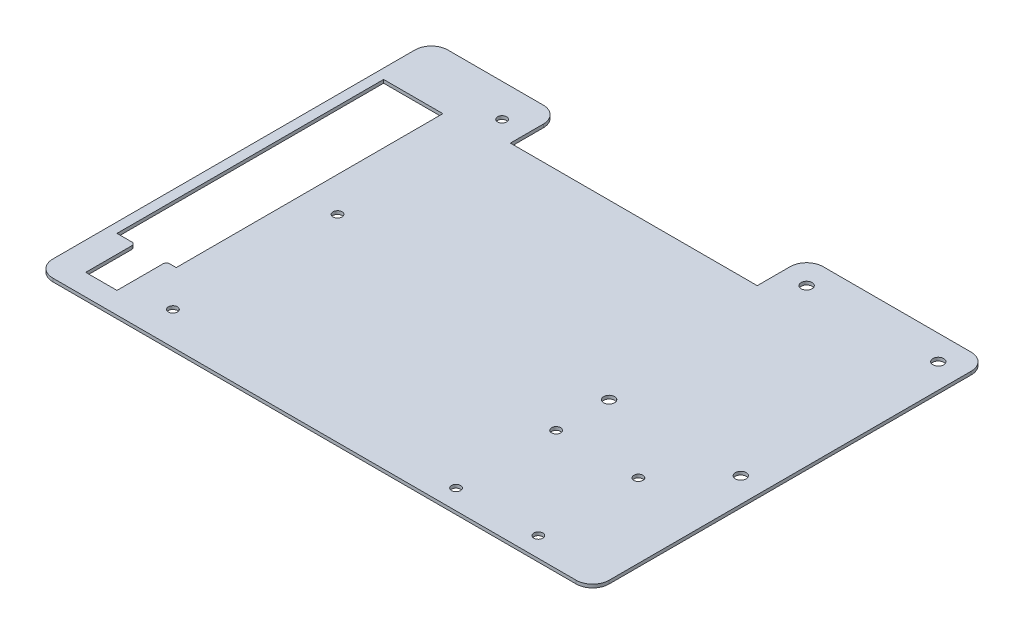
ISO-10303-21;
HEADER;
FILE_DESCRIPTION(('STEP AP214'),'2;1');
FILE_NAME('part.step','',(''),(''),'','','');
FILE_SCHEMA(('AUTOMOTIVE_DESIGN { 1 0 10303 214 1 1 1 1 }'));
ENDSEC;
DATA;
#1=APPLICATION_CONTEXT('core data for automotive mechanical design processes');
#2=APPLICATION_PROTOCOL_DEFINITION('international standard','automotive_design',2000,#1);
#3=PRODUCT_CONTEXT('',#1,'mechanical');
#4=PRODUCT('Part','Part','',(#3));
#5=PRODUCT_RELATED_PRODUCT_CATEGORY('part','',(#4));
#6=PRODUCT_DEFINITION_FORMATION('','',#4);
#7=PRODUCT_DEFINITION_CONTEXT('part definition',#1,'design');
#8=PRODUCT_DEFINITION('design','',#6,#7);
#9=PRODUCT_DEFINITION_SHAPE('','',#8);
#10=(LENGTH_UNIT() NAMED_UNIT(*) SI_UNIT(.MILLI.,.METRE.));
#11=(NAMED_UNIT(*) PLANE_ANGLE_UNIT() SI_UNIT($,.RADIAN.));
#12=(NAMED_UNIT(*) SI_UNIT($,.STERADIAN.) SOLID_ANGLE_UNIT());
#13=UNCERTAINTY_MEASURE_WITH_UNIT(LENGTH_MEASURE(1.E-05),#10,'distance_accuracy_value','');
#14=(GEOMETRIC_REPRESENTATION_CONTEXT(3) GLOBAL_UNCERTAINTY_ASSIGNED_CONTEXT((#13)) GLOBAL_UNIT_ASSIGNED_CONTEXT((#10,
#11,#12)) REPRESENTATION_CONTEXT('',''));
#15=CARTESIAN_POINT('',(0.,0.,0.));
#16=DIRECTION('',(0.,0.,1.));
#17=DIRECTION('',(1.,0.,0.));
#18=AXIS2_PLACEMENT_3D('',#15,#16,#17);
#19=CARTESIAN_POINT('',(-150.,2.,-120.));
#20=DIRECTION('',(0.,0.,1.));
#21=DIRECTION('',(1.,0.,0.));
#22=AXIS2_PLACEMENT_3D('',#19,#20,#21);
#23=PLANE('',#22);
#24=DIRECTION('',(-1.,0.,0.));
#25=VECTOR('',#24,1.);
#26=CARTESIAN_POINT('',(-150.,0.,-120.));
#27=LINE('',#26,#25);
#28=CARTESIAN_POINT('',(-110.,0.,-120.));
#29=VERTEX_POINT('',#28);
#30=CARTESIAN_POINT('',(-168.,0.,-120.));
#31=VERTEX_POINT('',#30);
#32=EDGE_CURVE('E400',#29,#31,#27,.T.);
#33=ORIENTED_EDGE('',*,*,#32,.T.);
#34=DIRECTION('',(0.,-1.,0.));
#35=VECTOR('',#34,1.);
#36=CARTESIAN_POINT('',(-168.,2.,-120.));
#37=LINE('',#36,#35);
#38=CARTESIAN_POINT('',(-168.,2.,-120.));
#39=VERTEX_POINT('',#38);
#40=EDGE_CURVE('E62',#31,#39,#37,.F.);
#41=ORIENTED_EDGE('',*,*,#40,.T.);
#42=DIRECTION('',(-1.,0.,0.));
#43=VECTOR('',#42,1.);
#44=CARTESIAN_POINT('',(-150.,2.,-120.));
#45=LINE('',#44,#43);
#46=CARTESIAN_POINT('',(-110.,2.,-120.));
#47=VERTEX_POINT('',#46);
#48=EDGE_CURVE('E388',#47,#39,#45,.T.);
#49=ORIENTED_EDGE('',*,*,#48,.F.);
#50=DIRECTION('',(0.,1.,0.));
#51=VECTOR('',#50,1.);
#52=CARTESIAN_POINT('',(-110.,2.,-120.));
#53=LINE('',#52,#51);
#54=EDGE_CURVE('E437',#47,#29,#53,.F.);
#55=ORIENTED_EDGE('',*,*,#54,.T.);
#56=EDGE_LOOP('',(#33,#41,#49,#55));
#57=FACE_BOUND('',#56,.T.);
#58=ADVANCED_FACE('F39',(#57),#23,.F.);
#59=CARTESIAN_POINT('',(-150.,2.,120.));
#60=DIRECTION('',(0.,0.,-1.));
#61=DIRECTION('',(-1.,0.,0.));
#62=AXIS2_PLACEMENT_3D('',#59,#60,#61);
#63=PLANE('',#62);
#64=DIRECTION('',(1.,0.,0.));
#65=VECTOR('',#64,1.);
#66=CARTESIAN_POINT('',(-150.,2.,120.));
#67=LINE('',#66,#65);
#68=CARTESIAN_POINT('',(-168.,2.,120.));
#69=VERTEX_POINT('',#68);
#70=CARTESIAN_POINT('',(150.,2.,120.));
#71=VERTEX_POINT('',#70);
#72=EDGE_CURVE('E379',#69,#71,#67,.T.);
#73=ORIENTED_EDGE('',*,*,#72,.F.);
#74=DIRECTION('',(0.,-1.,0.));
#75=VECTOR('',#74,1.);
#76=CARTESIAN_POINT('',(-168.,2.,120.));
#77=LINE('',#76,#75);
#78=CARTESIAN_POINT('',(-168.,0.,120.));
#79=VERTEX_POINT('',#78);
#80=EDGE_CURVE('E11',#69,#79,#77,.T.);
#81=ORIENTED_EDGE('',*,*,#80,.T.);
#82=DIRECTION('',(1.,0.,0.));
#83=VECTOR('',#82,1.);
#84=CARTESIAN_POINT('',(-150.,0.,120.));
#85=LINE('',#84,#83);
#86=CARTESIAN_POINT('',(150.,0.,120.));
#87=VERTEX_POINT('',#86);
#88=EDGE_CURVE('E364',#79,#87,#85,.T.);
#89=ORIENTED_EDGE('',*,*,#88,.T.);
#90=DIRECTION('',(0.,-1.,0.));
#91=VECTOR('',#90,1.);
#92=CARTESIAN_POINT('',(150.,2.,120.));
#93=LINE('',#92,#91);
#94=EDGE_CURVE('E411',#71,#87,#93,.T.);
#95=ORIENTED_EDGE('',*,*,#94,.F.);
#96=EDGE_LOOP('',(#73,#81,#89,#95));
#97=FACE_BOUND('',#96,.T.);
#98=ADVANCED_FACE('F508',(#97),#63,.F.);
#99=CARTESIAN_POINT('',(150.,2.,110.));
#100=DIRECTION('',(0.,-1.,0.));
#101=DIRECTION('',(0.,0.,-1.));
#102=AXIS2_PLACEMENT_3D('',#99,#100,#101);
#103=CYLINDRICAL_SURFACE('',#102,10.);
#104=CARTESIAN_POINT('',(150.,0.,110.));
#105=DIRECTION('',(0.,1.,0.));
#106=DIRECTION('',(0.,0.,1.));
#107=AXIS2_PLACEMENT_3D('',#104,#105,#106);
#108=CIRCLE('',#107,10.);
#109=CARTESIAN_POINT('',(160.,0.,110.));
#110=VERTEX_POINT('',#109);
#111=EDGE_CURVE('E394',#87,#110,#108,.T.);
#112=ORIENTED_EDGE('',*,*,#111,.T.);
#113=DIRECTION('',(0.,-1.,0.));
#114=VECTOR('',#113,1.);
#115=CARTESIAN_POINT('',(160.,2.,110.));
#116=LINE('',#115,#114);
#117=CARTESIAN_POINT('',(160.,2.,110.));
#118=VERTEX_POINT('',#117);
#119=EDGE_CURVE('E408',#118,#110,#116,.T.);
#120=ORIENTED_EDGE('',*,*,#119,.F.);
#121=CARTESIAN_POINT('',(150.,2.,110.));
#122=DIRECTION('',(0.,1.,0.));
#123=DIRECTION('',(0.,0.,1.));
#124=AXIS2_PLACEMENT_3D('',#121,#122,#123);
#125=CIRCLE('',#124,10.);
#126=EDGE_CURVE('E381',#71,#118,#125,.T.);
#127=ORIENTED_EDGE('',*,*,#126,.F.);
#128=ORIENTED_EDGE('',*,*,#94,.T.);
#129=EDGE_LOOP('',(#112,#120,#127,#128));
#130=FACE_BOUND('',#129,.T.);
#131=ADVANCED_FACE('F505',(#130),#103,.T.);
#132=CARTESIAN_POINT('',(160.,2.,110.));
#133=DIRECTION('',(-1.,0.,0.));
#134=DIRECTION('',(0.,0.,1.));
#135=AXIS2_PLACEMENT_3D('',#132,#133,#134);
#136=PLANE('',#135);
#137=DIRECTION('',(0.,0.,-1.));
#138=VECTOR('',#137,1.);
#139=CARTESIAN_POINT('',(160.,0.,110.));
#140=LINE('',#139,#138);
#141=CARTESIAN_POINT('',(160.,0.,-110.));
#142=VERTEX_POINT('',#141);
#143=EDGE_CURVE('E396',#110,#142,#140,.T.);
#144=ORIENTED_EDGE('',*,*,#143,.T.);
#145=DIRECTION('',(0.,-1.,0.));
#146=VECTOR('',#145,1.);
#147=CARTESIAN_POINT('',(160.,2.,-110.));
#148=LINE('',#147,#146);
#149=CARTESIAN_POINT('',(160.,2.,-110.));
#150=VERTEX_POINT('',#149);
#151=EDGE_CURVE('E405',#150,#142,#148,.T.);
#152=ORIENTED_EDGE('',*,*,#151,.F.);
#153=DIRECTION('',(0.,0.,-1.));
#154=VECTOR('',#153,1.);
#155=CARTESIAN_POINT('',(160.,2.,110.));
#156=LINE('',#155,#154);
#157=EDGE_CURVE('E384',#118,#150,#156,.T.);
#158=ORIENTED_EDGE('',*,*,#157,.F.);
#159=ORIENTED_EDGE('',*,*,#119,.T.);
#160=EDGE_LOOP('',(#144,#152,#158,#159));
#161=FACE_BOUND('',#160,.T.);
#162=ADVANCED_FACE('F500',(#161),#136,.F.);
#163=CARTESIAN_POINT('',(150.,2.,-110.));
#164=DIRECTION('',(0.,-1.,0.));
#165=DIRECTION('',(0.,0.,-1.));
#166=AXIS2_PLACEMENT_3D('',#163,#164,#165);
#167=CYLINDRICAL_SURFACE('',#166,10.);
#168=CARTESIAN_POINT('',(150.,0.,-110.));
#169=DIRECTION('',(0.,1.,0.));
#170=DIRECTION('',(0.,0.,-1.));
#171=AXIS2_PLACEMENT_3D('',#168,#169,#170);
#172=CIRCLE('',#171,10.);
#173=CARTESIAN_POINT('',(150.,0.,-120.));
#174=VERTEX_POINT('',#173);
#175=EDGE_CURVE('E398',#142,#174,#172,.T.);
#176=ORIENTED_EDGE('',*,*,#175,.T.);
#177=DIRECTION('',(0.,-1.,0.));
#178=VECTOR('',#177,1.);
#179=CARTESIAN_POINT('',(150.,2.,-120.));
#180=LINE('',#179,#178);
#181=CARTESIAN_POINT('',(150.,2.,-120.));
#182=VERTEX_POINT('',#181);
#183=EDGE_CURVE('E392',#182,#174,#180,.T.);
#184=ORIENTED_EDGE('',*,*,#183,.F.);
#185=CARTESIAN_POINT('',(150.,2.,-110.));
#186=DIRECTION('',(0.,1.,0.));
#187=DIRECTION('',(0.,0.,-1.));
#188=AXIS2_PLACEMENT_3D('',#185,#186,#187);
#189=CIRCLE('',#188,10.);
#190=EDGE_CURVE('E386',#150,#182,#189,.T.);
#191=ORIENTED_EDGE('',*,*,#190,.F.);
#192=ORIENTED_EDGE('',*,*,#151,.T.);
#193=EDGE_LOOP('',(#176,#184,#191,#192));
#194=FACE_BOUND('',#193,.T.);
#195=ADVANCED_FACE('F494',(#194),#167,.T.);
#196=CARTESIAN_POINT('',(60.0000000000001,0.,-120.));
#197=VERTEX_POINT('',#196);
#198=EDGE_CURVE('E382',#174,#197,#27,.T.);
#199=ORIENTED_EDGE('',*,*,#198,.T.);
#200=DIRECTION('',(0.,1.,0.));
#201=VECTOR('',#200,1.);
#202=CARTESIAN_POINT('',(60.0000000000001,2.,-120.));
#203=LINE('',#202,#201);
#204=CARTESIAN_POINT('',(60.0000000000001,2.,-120.));
#205=VERTEX_POINT('',#204);
#206=EDGE_CURVE('E421',#197,#205,#203,.T.);
#207=ORIENTED_EDGE('',*,*,#206,.T.);
#208=EDGE_CURVE('E389',#182,#205,#45,.T.);
#209=ORIENTED_EDGE('',*,*,#208,.F.);
#210=ORIENTED_EDGE('',*,*,#183,.T.);
#211=EDGE_LOOP('',(#199,#207,#209,#210));
#212=FACE_BOUND('',#211,.T.);
#213=ADVANCED_FACE('F489',(#212),#23,.F.);
#214=CARTESIAN_POINT('',(-150.,2.,110.));
#215=DIRECTION('',(0.,-1.,0.));
#216=DIRECTION('',(0.,0.,-1.));
#217=AXIS2_PLACEMENT_3D('',#214,#215,#216);
#218=PLANE('',#217);
#219=DIRECTION('',(1.,0.,0.));
#220=VECTOR('',#219,1.);
#221=CARTESIAN_POINT('',(-172.,2.,77.));
#222=LINE('',#221,#220);
#223=CARTESIAN_POINT('',(-172.,2.,77.));
#224=VERTEX_POINT('',#223);
#225=CARTESIAN_POINT('',(-163.,2.,77.));
#226=VERTEX_POINT('',#225);
#227=EDGE_CURVE('E255',#224,#226,#222,.T.);
#228=ORIENTED_EDGE('',*,*,#227,.F.);
#229=DIRECTION('',(0.,0.,1.));
#230=VECTOR('',#229,1.);
#231=CARTESIAN_POINT('',(-172.,2.,77.));
#232=LINE('',#231,#230);
#233=CARTESIAN_POINT('',(-172.,2.,-85.));
#234=VERTEX_POINT('',#233);
#235=EDGE_CURVE('E210',#234,#224,#232,.T.);
#236=ORIENTED_EDGE('',*,*,#235,.F.);
#237=DIRECTION('',(-1.,0.,0.));
#238=VECTOR('',#237,1.);
#239=CARTESIAN_POINT('',(-172.,2.,-85.));
#240=LINE('',#239,#238);
#241=CARTESIAN_POINT('',(-136.,2.,-85.));
#242=VERTEX_POINT('',#241);
#243=EDGE_CURVE('E229',#242,#234,#240,.T.);
#244=ORIENTED_EDGE('',*,*,#243,.F.);
#245=DIRECTION('',(0.,0.,-1.));
#246=VECTOR('',#245,1.);
#247=CARTESIAN_POINT('',(-136.,2.,77.));
#248=LINE('',#247,#246);
#249=CARTESIAN_POINT('',(-136.,2.,77.));
#250=VERTEX_POINT('',#249);
#251=EDGE_CURVE('E232',#250,#242,#248,.T.);
#252=ORIENTED_EDGE('',*,*,#251,.F.);
#253=DIRECTION('',(1.,0.,0.));
#254=VECTOR('',#253,1.);
#255=CARTESIAN_POINT('',(-140.,2.,77.));
#256=LINE('',#255,#254);
#257=CARTESIAN_POINT('',(-140.,2.,77.));
#258=VERTEX_POINT('',#257);
#259=EDGE_CURVE('E272',#258,#250,#256,.T.);
#260=ORIENTED_EDGE('',*,*,#259,.F.);
#261=CARTESIAN_POINT('',(-140.,2.,79.));
#262=DIRECTION('',(0.,-1.,0.));
#263=DIRECTION('',(0.,0.,1.));
#264=AXIS2_PLACEMENT_3D('',#261,#262,#263);
#265=CIRCLE('',#264,2.);
#266=CARTESIAN_POINT('',(-142.,2.,79.));
#267=VERTEX_POINT('',#266);
#268=EDGE_CURVE('E269',#267,#258,#265,.T.);
#269=ORIENTED_EDGE('',*,*,#268,.F.);
#270=DIRECTION('',(0.,0.,-1.));
#271=VECTOR('',#270,1.);
#272=CARTESIAN_POINT('',(-142.,2.,79.));
#273=LINE('',#272,#271);
#274=CARTESIAN_POINT('',(-142.,2.,107.));
#275=VERTEX_POINT('',#274);
#276=EDGE_CURVE('E266',#275,#267,#273,.T.);
#277=ORIENTED_EDGE('',*,*,#276,.F.);
#278=DIRECTION('',(1.,0.,0.));
#279=VECTOR('',#278,1.);
#280=CARTESIAN_POINT('',(-161.,2.,107.));
#281=LINE('',#280,#279);
#282=CARTESIAN_POINT('',(-161.,2.,107.));
#283=VERTEX_POINT('',#282);
#284=EDGE_CURVE('E263',#283,#275,#281,.T.);
#285=ORIENTED_EDGE('',*,*,#284,.F.);
#286=DIRECTION('',(0.,0.,1.));
#287=VECTOR('',#286,1.);
#288=CARTESIAN_POINT('',(-161.,2.,79.0000000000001));
#289=LINE('',#288,#287);
#290=CARTESIAN_POINT('',(-161.,2.,79.0000000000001));
#291=VERTEX_POINT('',#290);
#292=EDGE_CURVE('E260',#291,#283,#289,.T.);
#293=ORIENTED_EDGE('',*,*,#292,.F.);
#294=CARTESIAN_POINT('',(-163.,2.,79.));
#295=DIRECTION('',(0.,-1.,0.));
#296=DIRECTION('',(0.,0.,-1.));
#297=AXIS2_PLACEMENT_3D('',#294,#295,#296);
#298=CIRCLE('',#297,2.);
#299=EDGE_CURVE('E257',#226,#291,#298,.T.);
#300=ORIENTED_EDGE('',*,*,#299,.F.);
#301=EDGE_LOOP('',(#228,#236,#244,#252,#260,#269,#277,#285,#293,#300));
#302=FACE_BOUND('',#301,.T.);
#303=ORIENTED_EDGE('',*,*,#48,.T.);
#304=CARTESIAN_POINT('',(-168.,2.,-110.));
#305=DIRECTION('',(0.,-1.,0.));
#306=DIRECTION('',(0.,0.,-1.));
#307=AXIS2_PLACEMENT_3D('',#304,#305,#306);
#308=CIRCLE('',#307,10.);
#309=CARTESIAN_POINT('',(-178.,2.,-110.));
#310=VERTEX_POINT('',#309);
#311=EDGE_CURVE('E47',#39,#310,#308,.F.);
#312=ORIENTED_EDGE('',*,*,#311,.T.);
#313=DIRECTION('',(0.,0.,1.));
#314=VECTOR('',#313,1.);
#315=CARTESIAN_POINT('',(-178.,2.,120.));
#316=LINE('',#315,#314);
#317=CARTESIAN_POINT('',(-178.,2.,110.));
#318=VERTEX_POINT('',#317);
#319=EDGE_CURVE('E295',#310,#318,#316,.T.);
#320=ORIENTED_EDGE('',*,*,#319,.T.);
#321=CARTESIAN_POINT('',(-168.,2.,110.));
#322=DIRECTION('',(0.,-1.,0.));
#323=DIRECTION('',(0.,0.,-1.));
#324=AXIS2_PLACEMENT_3D('',#321,#322,#323);
#325=CIRCLE('',#324,10.);
#326=EDGE_CURVE('E54',#318,#69,#325,.F.);
#327=ORIENTED_EDGE('',*,*,#326,.T.);
#328=ORIENTED_EDGE('',*,*,#72,.T.);
#329=ORIENTED_EDGE('',*,*,#126,.T.);
#330=ORIENTED_EDGE('',*,*,#157,.T.);
#331=ORIENTED_EDGE('',*,*,#190,.T.);
#332=ORIENTED_EDGE('',*,*,#208,.T.);
#333=CARTESIAN_POINT('',(60.0000000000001,2.,-110.));
#334=DIRECTION('',(0.,-1.,0.));
#335=DIRECTION('',(0.,0.,-1.));
#336=AXIS2_PLACEMENT_3D('',#333,#334,#335);
#337=CIRCLE('',#336,10.);
#338=CARTESIAN_POINT('',(50.0000000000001,2.,-110.));
#339=VERTEX_POINT('',#338);
#340=EDGE_CURVE('E426',#205,#339,#337,.F.);
#341=ORIENTED_EDGE('',*,*,#340,.T.);
#342=DIRECTION('',(0.,0.,-1.));
#343=VECTOR('',#342,1.);
#344=CARTESIAN_POINT('',(50.0000000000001,2.,-120.));
#345=LINE('',#344,#343);
#346=CARTESIAN_POINT('',(50.0000000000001,2.,-90.));
#347=VERTEX_POINT('',#346);
#348=EDGE_CURVE('E304',#347,#339,#345,.T.);
#349=ORIENTED_EDGE('',*,*,#348,.F.);
#350=DIRECTION('',(1.,0.,0.));
#351=VECTOR('',#350,1.);
#352=CARTESIAN_POINT('',(-100.,2.,-90.));
#353=LINE('',#352,#351);
#354=CARTESIAN_POINT('',(-100.,2.,-90.));
#355=VERTEX_POINT('',#354);
#356=EDGE_CURVE('E301',#355,#347,#353,.T.);
#357=ORIENTED_EDGE('',*,*,#356,.F.);
#358=DIRECTION('',(0.,0.,1.));
#359=VECTOR('',#358,1.);
#360=CARTESIAN_POINT('',(-100.,2.,-120.));
#361=LINE('',#360,#359);
#362=CARTESIAN_POINT('',(-100.,2.,-110.));
#363=VERTEX_POINT('',#362);
#364=EDGE_CURVE('E297',#363,#355,#361,.T.);
#365=ORIENTED_EDGE('',*,*,#364,.F.);
#366=CARTESIAN_POINT('',(-110.,2.,-110.));
#367=DIRECTION('',(0.,-1.,0.));
#368=DIRECTION('',(0.,0.,-1.));
#369=AXIS2_PLACEMENT_3D('',#366,#367,#368);
#370=CIRCLE('',#369,10.);
#371=EDGE_CURVE('E424',#363,#47,#370,.F.);
#372=ORIENTED_EDGE('',*,*,#371,.T.);
#373=EDGE_LOOP('',(#303,#312,#320,#327,#328,#329,#330,#331,#332,#341,#349,#357,#365,#372));
#374=FACE_BOUND('',#373,.T.);
#375=CARTESIAN_POINT('',(-115.,2.,-100.));
#376=DIRECTION('',(0.,1.,0.));
#377=DIRECTION('',(0.,0.,1.));
#378=AXIS2_PLACEMENT_3D('',#375,#376,#377);
#379=CIRCLE('',#378,2.75000000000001);
#380=CARTESIAN_POINT('',(-115.,2.,-97.25));
#381=VERTEX_POINT('',#380);
#382=EDGE_CURVE('E374',#381,#381,#379,.T.);
#383=ORIENTED_EDGE('',*,*,#382,.F.);
#384=EDGE_LOOP('',(#383));
#385=FACE_BOUND('',#384,.T.);
#386=CARTESIAN_POINT('',(-115.,2.,0.));
#387=DIRECTION('',(0.,1.,0.));
#388=DIRECTION('',(0.,0.,1.));
#389=AXIS2_PLACEMENT_3D('',#386,#387,#388);
#390=CIRCLE('',#389,2.75000000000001);
#391=CARTESIAN_POINT('',(-115.,2.,2.75000000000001));
#392=VERTEX_POINT('',#391);
#393=EDGE_CURVE('E368',#392,#392,#390,.T.);
#394=ORIENTED_EDGE('',*,*,#393,.F.);
#395=EDGE_LOOP('',(#394));
#396=FACE_BOUND('',#395,.T.);
#397=CARTESIAN_POINT('',(-115.,2.,100.));
#398=DIRECTION('',(0.,1.,0.));
#399=DIRECTION('',(0.,0.,1.));
#400=AXIS2_PLACEMENT_3D('',#397,#398,#399);
#401=CIRCLE('',#400,2.75000000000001);
#402=CARTESIAN_POINT('',(-115.,2.,102.75));
#403=VERTEX_POINT('',#402);
#404=EDGE_CURVE('E365',#403,#403,#401,.T.);
#405=ORIENTED_EDGE('',*,*,#404,.F.);
#406=EDGE_LOOP('',(#405));
#407=FACE_BOUND('',#406,.T.);
#408=CARTESIAN_POINT('',(145.,2.,-105.));
#409=DIRECTION('',(0.,1.,0.));
#410=DIRECTION('',(0.,0.,1.));
#411=AXIS2_PLACEMENT_3D('',#408,#409,#410);
#412=CIRCLE('',#411,3.3);
#413=CARTESIAN_POINT('',(145.,2.,-101.7));
#414=VERTEX_POINT('',#413);
#415=EDGE_CURVE('E346',#414,#414,#412,.T.);
#416=ORIENTED_EDGE('',*,*,#415,.F.);
#417=EDGE_LOOP('',(#416));
#418=FACE_BOUND('',#417,.T.);
#419=CARTESIAN_POINT('',(115.,2.,47.2));
#420=DIRECTION('',(0.,1.,0.));
#421=DIRECTION('',(0.,0.,1.));
#422=AXIS2_PLACEMENT_3D('',#419,#420,#421);
#423=CIRCLE('',#422,2.75000000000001);
#424=CARTESIAN_POINT('',(115.,2.,49.95));
#425=VERTEX_POINT('',#424);
#426=EDGE_CURVE('E326',#425,#425,#423,.T.);
#427=ORIENTED_EDGE('',*,*,#426,.F.);
#428=EDGE_LOOP('',(#427));
#429=FACE_BOUND('',#428,.T.);
#430=CARTESIAN_POINT('',(65.0000000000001,2.,47.2));
#431=DIRECTION('',(0.,1.,0.));
#432=DIRECTION('',(0.,0.,1.));
#433=AXIS2_PLACEMENT_3D('',#430,#431,#432);
#434=CIRCLE('',#433,2.75000000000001);
#435=CARTESIAN_POINT('',(65.0000000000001,2.,49.95));
#436=VERTEX_POINT('',#435);
#437=EDGE_CURVE('E320',#436,#436,#434,.T.);
#438=ORIENTED_EDGE('',*,*,#437,.F.);
#439=EDGE_LOOP('',(#438));
#440=FACE_BOUND('',#439,.T.);
#441=CARTESIAN_POINT('',(65.0000000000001,2.,108.));
#442=DIRECTION('',(0.,1.,0.));
#443=DIRECTION('',(0.,0.,1.));
#444=AXIS2_PLACEMENT_3D('',#441,#442,#443);
#445=CIRCLE('',#444,2.75000000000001);
#446=CARTESIAN_POINT('',(65.0000000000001,2.,110.75));
#447=VERTEX_POINT('',#446);
#448=EDGE_CURVE('E313',#447,#447,#445,.T.);
#449=ORIENTED_EDGE('',*,*,#448,.F.);
#450=EDGE_LOOP('',(#449));
#451=FACE_BOUND('',#450,.T.);
#452=CARTESIAN_POINT('',(65.0000000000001,2.,15.));
#453=DIRECTION('',(0.,1.,0.));
#454=DIRECTION('',(0.,0.,1.));
#455=AXIS2_PLACEMENT_3D('',#452,#453,#454);
#456=CIRCLE('',#455,3.30000000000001);
#457=CARTESIAN_POINT('',(65.0000000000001,2.,18.3));
#458=VERTEX_POINT('',#457);
#459=EDGE_CURVE('E343',#458,#458,#456,.T.);
#460=ORIENTED_EDGE('',*,*,#459,.F.);
#461=EDGE_LOOP('',(#460));
#462=FACE_BOUND('',#461,.T.);
#463=CARTESIAN_POINT('',(145.,2.,15.));
#464=DIRECTION('',(0.,1.,0.));
#465=DIRECTION('',(0.,0.,1.));
#466=AXIS2_PLACEMENT_3D('',#463,#464,#465);
#467=CIRCLE('',#466,3.3);
#468=CARTESIAN_POINT('',(145.,2.,18.3));
#469=VERTEX_POINT('',#468);
#470=EDGE_CURVE('E350',#469,#469,#467,.T.);
#471=ORIENTED_EDGE('',*,*,#470,.F.);
#472=EDGE_LOOP('',(#471));
#473=FACE_BOUND('',#472,.T.);
#474=CARTESIAN_POINT('',(65.0000000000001,2.,-105.));
#475=DIRECTION('',(0.,1.,0.));
#476=DIRECTION('',(0.,0.,1.));
#477=AXIS2_PLACEMENT_3D('',#474,#475,#476);
#478=CIRCLE('',#477,3.29999999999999);
#479=CARTESIAN_POINT('',(65.0000000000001,2.,-101.7));
#480=VERTEX_POINT('',#479);
#481=EDGE_CURVE('E331',#480,#480,#478,.T.);
#482=ORIENTED_EDGE('',*,*,#481,.F.);
#483=EDGE_LOOP('',(#482));
#484=FACE_BOUND('',#483,.T.);
#485=CARTESIAN_POINT('',(115.,2.,108.));
#486=DIRECTION('',(0.,1.,0.));
#487=DIRECTION('',(0.,0.,1.));
#488=AXIS2_PLACEMENT_3D('',#485,#486,#487);
#489=CIRCLE('',#488,2.75000000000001);
#490=CARTESIAN_POINT('',(115.,2.,110.75));
#491=VERTEX_POINT('',#490);
#492=EDGE_CURVE('E338',#491,#491,#489,.T.);
#493=ORIENTED_EDGE('',*,*,#492,.F.);
#494=EDGE_LOOP('',(#493));
#495=FACE_BOUND('',#494,.T.);
#496=ADVANCED_FACE('F451',(#302,#374,#385,#396,#407,#418,#429,#440,#451,#462,#473,#484,#495),
#218,.F.);
#497=CARTESIAN_POINT('',(-150.,0.,110.));
#498=DIRECTION('',(0.,-1.,0.));
#499=DIRECTION('',(0.,0.,-1.));
#500=AXIS2_PLACEMENT_3D('',#497,#498,#499);
#501=PLANE('',#500);
#502=DIRECTION('',(0.,0.,1.));
#503=VECTOR('',#502,1.);
#504=CARTESIAN_POINT('',(-172.,0.,77.));
#505=LINE('',#504,#503);
#506=CARTESIAN_POINT('',(-172.,0.,-85.));
#507=VERTEX_POINT('',#506);
#508=CARTESIAN_POINT('',(-172.,0.,77.));
#509=VERTEX_POINT('',#508);
#510=EDGE_CURVE('E207',#507,#509,#505,.T.);
#511=ORIENTED_EDGE('',*,*,#510,.T.);
#512=DIRECTION('',(1.,0.,0.));
#513=VECTOR('',#512,1.);
#514=CARTESIAN_POINT('',(-172.,0.,77.));
#515=LINE('',#514,#513);
#516=CARTESIAN_POINT('',(-163.,0.,77.));
#517=VERTEX_POINT('',#516);
#518=EDGE_CURVE('E219',#509,#517,#515,.T.);
#519=ORIENTED_EDGE('',*,*,#518,.T.);
#520=CARTESIAN_POINT('',(-163.,0.,79.));
#521=DIRECTION('',(0.,-1.,0.));
#522=DIRECTION('',(0.,0.,-1.));
#523=AXIS2_PLACEMENT_3D('',#520,#521,#522);
#524=CIRCLE('',#523,2.);
#525=CARTESIAN_POINT('',(-161.,0.,79.0000000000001));
#526=VERTEX_POINT('',#525);
#527=EDGE_CURVE('E223',#517,#526,#524,.T.);
#528=ORIENTED_EDGE('',*,*,#527,.T.);
#529=DIRECTION('',(0.,0.,1.));
#530=VECTOR('',#529,1.);
#531=CARTESIAN_POINT('',(-161.,0.,79.0000000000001));
#532=LINE('',#531,#530);
#533=CARTESIAN_POINT('',(-161.,0.,107.));
#534=VERTEX_POINT('',#533);
#535=EDGE_CURVE('E236',#526,#534,#532,.T.);
#536=ORIENTED_EDGE('',*,*,#535,.T.);
#537=DIRECTION('',(1.,0.,0.));
#538=VECTOR('',#537,1.);
#539=CARTESIAN_POINT('',(-161.,0.,107.));
#540=LINE('',#539,#538);
#541=CARTESIAN_POINT('',(-142.,0.,107.));
#542=VERTEX_POINT('',#541);
#543=EDGE_CURVE('E239',#534,#542,#540,.T.);
#544=ORIENTED_EDGE('',*,*,#543,.T.);
#545=DIRECTION('',(0.,0.,-1.));
#546=VECTOR('',#545,1.);
#547=CARTESIAN_POINT('',(-142.,0.,79.));
#548=LINE('',#547,#546);
#549=CARTESIAN_POINT('',(-142.,0.,79.));
#550=VERTEX_POINT('',#549);
#551=EDGE_CURVE('E242',#542,#550,#548,.T.);
#552=ORIENTED_EDGE('',*,*,#551,.T.);
#553=CARTESIAN_POINT('',(-140.,0.,79.));
#554=DIRECTION('',(0.,-1.,0.));
#555=DIRECTION('',(0.,0.,1.));
#556=AXIS2_PLACEMENT_3D('',#553,#554,#555);
#557=CIRCLE('',#556,2.);
#558=CARTESIAN_POINT('',(-140.,0.,77.));
#559=VERTEX_POINT('',#558);
#560=EDGE_CURVE('E245',#550,#559,#557,.T.);
#561=ORIENTED_EDGE('',*,*,#560,.T.);
#562=DIRECTION('',(1.,0.,0.));
#563=VECTOR('',#562,1.);
#564=CARTESIAN_POINT('',(-140.,0.,77.));
#565=LINE('',#564,#563);
#566=CARTESIAN_POINT('',(-136.,0.,77.));
#567=VERTEX_POINT('',#566);
#568=EDGE_CURVE('E248',#559,#567,#565,.T.);
#569=ORIENTED_EDGE('',*,*,#568,.T.);
#570=DIRECTION('',(0.,0.,-1.));
#571=VECTOR('',#570,1.);
#572=CARTESIAN_POINT('',(-136.,0.,77.));
#573=LINE('',#572,#571);
#574=CARTESIAN_POINT('',(-136.,0.,-85.));
#575=VERTEX_POINT('',#574);
#576=EDGE_CURVE('E251',#567,#575,#573,.T.);
#577=ORIENTED_EDGE('',*,*,#576,.T.);
#578=DIRECTION('',(-1.,0.,0.));
#579=VECTOR('',#578,1.);
#580=CARTESIAN_POINT('',(-172.,0.,-85.));
#581=LINE('',#580,#579);
#582=EDGE_CURVE('E215',#575,#507,#581,.T.);
#583=ORIENTED_EDGE('',*,*,#582,.T.);
#584=EDGE_LOOP('',(#511,#519,#528,#536,#544,#552,#561,#569,#577,#583));
#585=FACE_BOUND('',#584,.T.);
#586=DIRECTION('',(0.,0.,1.));
#587=VECTOR('',#586,1.);
#588=CARTESIAN_POINT('',(-178.,0.,120.));
#589=LINE('',#588,#587);
#590=CARTESIAN_POINT('',(-178.,0.,-110.));
#591=VERTEX_POINT('',#590);
#592=CARTESIAN_POINT('',(-178.,0.,110.));
#593=VERTEX_POINT('',#592);
#594=EDGE_CURVE('E279',#591,#593,#589,.T.);
#595=ORIENTED_EDGE('',*,*,#594,.F.);
#596=CARTESIAN_POINT('',(-168.,0.,-110.));
#597=DIRECTION('',(0.,-1.,0.));
#598=DIRECTION('',(0.,0.,-1.));
#599=AXIS2_PLACEMENT_3D('',#596,#597,#598);
#600=CIRCLE('',#599,10.);
#601=EDGE_CURVE('E446',#591,#31,#600,.T.);
#602=ORIENTED_EDGE('',*,*,#601,.T.);
#603=ORIENTED_EDGE('',*,*,#32,.F.);
#604=CARTESIAN_POINT('',(-110.,0.,-110.));
#605=DIRECTION('',(0.,-1.,0.));
#606=DIRECTION('',(0.,0.,-1.));
#607=AXIS2_PLACEMENT_3D('',#604,#605,#606);
#608=CIRCLE('',#607,10.);
#609=CARTESIAN_POINT('',(-100.,0.,-110.));
#610=VERTEX_POINT('',#609);
#611=EDGE_CURVE('E430',#29,#610,#608,.T.);
#612=ORIENTED_EDGE('',*,*,#611,.T.);
#613=DIRECTION('',(0.,0.,-1.));
#614=VECTOR('',#613,1.);
#615=CARTESIAN_POINT('',(-100.,0.,110.));
#616=LINE('',#615,#614);
#617=CARTESIAN_POINT('',(-100.,0.,-90.));
#618=VERTEX_POINT('',#617);
#619=EDGE_CURVE('E418',#618,#610,#616,.T.);
#620=ORIENTED_EDGE('',*,*,#619,.F.);
#621=DIRECTION('',(-1.,0.,0.));
#622=VECTOR('',#621,1.);
#623=CARTESIAN_POINT('',(-150.,0.,-90.));
#624=LINE('',#623,#622);
#625=CARTESIAN_POINT('',(50.0000000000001,0.,-90.));
#626=VERTEX_POINT('',#625);
#627=EDGE_CURVE('E414',#626,#618,#624,.T.);
#628=ORIENTED_EDGE('',*,*,#627,.F.);
#629=DIRECTION('',(0.,0.,1.));
#630=VECTOR('',#629,1.);
#631=CARTESIAN_POINT('',(50.0000000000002,0.,110.));
#632=LINE('',#631,#630);
#633=CARTESIAN_POINT('',(50.0000000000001,0.,-110.));
#634=VERTEX_POINT('',#633);
#635=EDGE_CURVE('E416',#634,#626,#632,.T.);
#636=ORIENTED_EDGE('',*,*,#635,.F.);
#637=CARTESIAN_POINT('',(60.0000000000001,0.,-110.));
#638=DIRECTION('',(0.,-1.,0.));
#639=DIRECTION('',(0.,0.,-1.));
#640=AXIS2_PLACEMENT_3D('',#637,#638,#639);
#641=CIRCLE('',#640,10.);
#642=EDGE_CURVE('E432',#634,#197,#641,.T.);
#643=ORIENTED_EDGE('',*,*,#642,.T.);
#644=ORIENTED_EDGE('',*,*,#198,.F.);
#645=ORIENTED_EDGE('',*,*,#175,.F.);
#646=ORIENTED_EDGE('',*,*,#143,.F.);
#647=ORIENTED_EDGE('',*,*,#111,.F.);
#648=ORIENTED_EDGE('',*,*,#88,.F.);
#649=CARTESIAN_POINT('',(-168.,0.,110.));
#650=DIRECTION('',(0.,-1.,0.));
#651=DIRECTION('',(0.,0.,-1.));
#652=AXIS2_PLACEMENT_3D('',#649,#650,#651);
#653=CIRCLE('',#652,10.);
#654=EDGE_CURVE('E444',#79,#593,#653,.T.);
#655=ORIENTED_EDGE('',*,*,#654,.T.);
#656=EDGE_LOOP('',(#595,#602,#603,#612,#620,#628,#636,#643,#644,#645,#646,#647,#648,#655));
#657=FACE_BOUND('',#656,.T.);
#658=CARTESIAN_POINT('',(115.,0.,108.));
#659=DIRECTION('',(0.,1.,0.));
#660=DIRECTION('',(0.,0.,1.));
#661=AXIS2_PLACEMENT_3D('',#658,#659,#660);
#662=CIRCLE('',#661,2.75000000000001);
#663=CARTESIAN_POINT('',(115.,0.,110.75));
#664=VERTEX_POINT('',#663);
#665=EDGE_CURVE('E316',#664,#664,#662,.T.);
#666=ORIENTED_EDGE('',*,*,#665,.T.);
#667=EDGE_LOOP('',(#666));
#668=FACE_BOUND('',#667,.T.);
#669=CARTESIAN_POINT('',(65.0000000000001,0.,-105.));
#670=DIRECTION('',(0.,1.,0.));
#671=DIRECTION('',(0.,0.,1.));
#672=AXIS2_PLACEMENT_3D('',#669,#670,#671);
#673=CIRCLE('',#672,3.29999999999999);
#674=CARTESIAN_POINT('',(65.0000000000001,0.,-101.7));
#675=VERTEX_POINT('',#674);
#676=EDGE_CURVE('E335',#675,#675,#673,.T.);
#677=ORIENTED_EDGE('',*,*,#676,.T.);
#678=EDGE_LOOP('',(#677));
#679=FACE_BOUND('',#678,.T.);
#680=CARTESIAN_POINT('',(145.,0.,15.));
#681=DIRECTION('',(0.,1.,0.));
#682=DIRECTION('',(0.,0.,1.));
#683=AXIS2_PLACEMENT_3D('',#680,#681,#682);
#684=CIRCLE('',#683,3.3);
#685=CARTESIAN_POINT('',(145.,0.,18.3));
#686=VERTEX_POINT('',#685);
#687=EDGE_CURVE('E334',#686,#686,#684,.T.);
#688=ORIENTED_EDGE('',*,*,#687,.T.);
#689=EDGE_LOOP('',(#688));
#690=FACE_BOUND('',#689,.T.);
#691=CARTESIAN_POINT('',(65.0000000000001,0.,15.));
#692=DIRECTION('',(0.,1.,0.));
#693=DIRECTION('',(0.,0.,1.));
#694=AXIS2_PLACEMENT_3D('',#691,#692,#693);
#695=CIRCLE('',#694,3.30000000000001);
#696=CARTESIAN_POINT('',(65.0000000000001,0.,18.3));
#697=VERTEX_POINT('',#696);
#698=EDGE_CURVE('E347',#697,#697,#695,.T.);
#699=ORIENTED_EDGE('',*,*,#698,.T.);
#700=EDGE_LOOP('',(#699));
#701=FACE_BOUND('',#700,.T.);
#702=CARTESIAN_POINT('',(65.0000000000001,0.,108.));
#703=DIRECTION('',(0.,1.,0.));
#704=DIRECTION('',(0.,0.,1.));
#705=AXIS2_PLACEMENT_3D('',#702,#703,#704);
#706=CIRCLE('',#705,2.75000000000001);
#707=CARTESIAN_POINT('',(65.0000000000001,0.,110.75));
#708=VERTEX_POINT('',#707);
#709=EDGE_CURVE('E317',#708,#708,#706,.T.);
#710=ORIENTED_EDGE('',*,*,#709,.T.);
#711=EDGE_LOOP('',(#710));
#712=FACE_BOUND('',#711,.T.);
#713=CARTESIAN_POINT('',(65.0000000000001,0.,47.2));
#714=DIRECTION('',(0.,1.,0.));
#715=DIRECTION('',(0.,0.,1.));
#716=AXIS2_PLACEMENT_3D('',#713,#714,#715);
#717=CIRCLE('',#716,2.75000000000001);
#718=CARTESIAN_POINT('',(65.0000000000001,0.,49.95));
#719=VERTEX_POINT('',#718);
#720=EDGE_CURVE('E323',#719,#719,#717,.T.);
#721=ORIENTED_EDGE('',*,*,#720,.T.);
#722=EDGE_LOOP('',(#721));
#723=FACE_BOUND('',#722,.T.);
#724=CARTESIAN_POINT('',(115.,0.,47.2));
#725=DIRECTION('',(0.,1.,0.));
#726=DIRECTION('',(0.,0.,1.));
#727=AXIS2_PLACEMENT_3D('',#724,#725,#726);
#728=CIRCLE('',#727,2.75000000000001);
#729=CARTESIAN_POINT('',(115.,0.,49.95));
#730=VERTEX_POINT('',#729);
#731=EDGE_CURVE('E310',#730,#730,#728,.T.);
#732=ORIENTED_EDGE('',*,*,#731,.T.);
#733=EDGE_LOOP('',(#732));
#734=FACE_BOUND('',#733,.T.);
#735=CARTESIAN_POINT('',(145.,0.,-105.));
#736=DIRECTION('',(0.,1.,0.));
#737=DIRECTION('',(0.,0.,1.));
#738=AXIS2_PLACEMENT_3D('',#735,#736,#737);
#739=CIRCLE('',#738,3.3);
#740=CARTESIAN_POINT('',(145.,0.,-101.7));
#741=VERTEX_POINT('',#740);
#742=EDGE_CURVE('E355',#741,#741,#739,.T.);
#743=ORIENTED_EDGE('',*,*,#742,.T.);
#744=EDGE_LOOP('',(#743));
#745=FACE_BOUND('',#744,.T.);
#746=CARTESIAN_POINT('',(-115.,0.,100.));
#747=DIRECTION('',(0.,1.,0.));
#748=DIRECTION('',(0.,0.,1.));
#749=AXIS2_PLACEMENT_3D('',#746,#747,#748);
#750=CIRCLE('',#749,2.75000000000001);
#751=CARTESIAN_POINT('',(-115.,0.,102.75));
#752=VERTEX_POINT('',#751);
#753=EDGE_CURVE('E361',#752,#752,#750,.T.);
#754=ORIENTED_EDGE('',*,*,#753,.T.);
#755=EDGE_LOOP('',(#754));
#756=FACE_BOUND('',#755,.T.);
#757=CARTESIAN_POINT('',(-115.,0.,0.));
#758=DIRECTION('',(0.,1.,0.));
#759=DIRECTION('',(0.,0.,1.));
#760=AXIS2_PLACEMENT_3D('',#757,#758,#759);
#761=CIRCLE('',#760,2.75000000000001);
#762=CARTESIAN_POINT('',(-115.,0.,2.75000000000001));
#763=VERTEX_POINT('',#762);
#764=EDGE_CURVE('E371',#763,#763,#761,.T.);
#765=ORIENTED_EDGE('',*,*,#764,.T.);
#766=EDGE_LOOP('',(#765));
#767=FACE_BOUND('',#766,.T.);
#768=CARTESIAN_POINT('',(-115.,0.,-100.));
#769=DIRECTION('',(0.,1.,0.));
#770=DIRECTION('',(0.,0.,1.));
#771=AXIS2_PLACEMENT_3D('',#768,#769,#770);
#772=CIRCLE('',#771,2.75000000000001);
#773=CARTESIAN_POINT('',(-115.,0.,-97.25));
#774=VERTEX_POINT('',#773);
#775=EDGE_CURVE('E358',#774,#774,#772,.T.);
#776=ORIENTED_EDGE('',*,*,#775,.T.);
#777=EDGE_LOOP('',(#776));
#778=FACE_BOUND('',#777,.T.);
#779=ADVANCED_FACE('F225',(#585,#657,#668,#679,#690,#701,#712,#723,#734,#745,#756,#767,#778),
#501,.T.);
#780=CARTESIAN_POINT('',(-115.,0.,-100.));
#781=DIRECTION('',(0.,1.,0.));
#782=DIRECTION('',(0.,0.,1.));
#783=AXIS2_PLACEMENT_3D('',#780,#781,#782);
#784=CYLINDRICAL_SURFACE('',#783,2.75000000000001);
#785=ORIENTED_EDGE('',*,*,#775,.F.);
#786=EDGE_LOOP('',(#785));
#787=FACE_BOUND('',#786,.T.);
#788=ORIENTED_EDGE('',*,*,#382,.T.);
#789=EDGE_LOOP('',(#788));
#790=FACE_BOUND('',#789,.T.);
#791=ADVANCED_FACE('F599',(#787,#790),#784,.F.);
#792=CARTESIAN_POINT('',(-115.,0.,0.));
#793=DIRECTION('',(0.,1.,0.));
#794=DIRECTION('',(0.,0.,1.));
#795=AXIS2_PLACEMENT_3D('',#792,#793,#794);
#796=CYLINDRICAL_SURFACE('',#795,2.75000000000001);
#797=ORIENTED_EDGE('',*,*,#764,.F.);
#798=EDGE_LOOP('',(#797));
#799=FACE_BOUND('',#798,.T.);
#800=ORIENTED_EDGE('',*,*,#393,.T.);
#801=EDGE_LOOP('',(#800));
#802=FACE_BOUND('',#801,.T.);
#803=ADVANCED_FACE('F595',(#799,#802),#796,.F.);
#804=CARTESIAN_POINT('',(-115.,0.,100.));
#805=DIRECTION('',(0.,1.,0.));
#806=DIRECTION('',(0.,0.,1.));
#807=AXIS2_PLACEMENT_3D('',#804,#805,#806);
#808=CYLINDRICAL_SURFACE('',#807,2.75000000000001);
#809=ORIENTED_EDGE('',*,*,#753,.F.);
#810=EDGE_LOOP('',(#809));
#811=FACE_BOUND('',#810,.T.);
#812=ORIENTED_EDGE('',*,*,#404,.T.);
#813=EDGE_LOOP('',(#812));
#814=FACE_BOUND('',#813,.T.);
#815=ADVANCED_FACE('F591',(#811,#814),#808,.F.);
#816=CARTESIAN_POINT('',(145.,0.,-105.));
#817=DIRECTION('',(0.,1.,0.));
#818=DIRECTION('',(0.,0.,1.));
#819=AXIS2_PLACEMENT_3D('',#816,#817,#818);
#820=CYLINDRICAL_SURFACE('',#819,3.3);
#821=ORIENTED_EDGE('',*,*,#742,.F.);
#822=EDGE_LOOP('',(#821));
#823=FACE_BOUND('',#822,.T.);
#824=ORIENTED_EDGE('',*,*,#415,.T.);
#825=EDGE_LOOP('',(#824));
#826=FACE_BOUND('',#825,.T.);
#827=ADVANCED_FACE('F573',(#823,#826),#820,.F.);
#828=CARTESIAN_POINT('',(115.,0.,47.2));
#829=DIRECTION('',(0.,1.,0.));
#830=DIRECTION('',(0.,0.,1.));
#831=AXIS2_PLACEMENT_3D('',#828,#829,#830);
#832=CYLINDRICAL_SURFACE('',#831,2.75000000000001);
#833=ORIENTED_EDGE('',*,*,#731,.F.);
#834=EDGE_LOOP('',(#833));
#835=FACE_BOUND('',#834,.T.);
#836=ORIENTED_EDGE('',*,*,#426,.T.);
#837=EDGE_LOOP('',(#836));
#838=FACE_BOUND('',#837,.T.);
#839=ADVANCED_FACE('F569',(#835,#838),#832,.F.);
#840=CARTESIAN_POINT('',(65.0000000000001,0.,47.2));
#841=DIRECTION('',(0.,1.,0.));
#842=DIRECTION('',(0.,0.,1.));
#843=AXIS2_PLACEMENT_3D('',#840,#841,#842);
#844=CYLINDRICAL_SURFACE('',#843,2.75000000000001);
#845=ORIENTED_EDGE('',*,*,#720,.F.);
#846=EDGE_LOOP('',(#845));
#847=FACE_BOUND('',#846,.T.);
#848=ORIENTED_EDGE('',*,*,#437,.T.);
#849=EDGE_LOOP('',(#848));
#850=FACE_BOUND('',#849,.T.);
#851=ADVANCED_FACE('F565',(#847,#850),#844,.F.);
#852=CARTESIAN_POINT('',(65.0000000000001,0.,108.));
#853=DIRECTION('',(0.,1.,0.));
#854=DIRECTION('',(0.,0.,1.));
#855=AXIS2_PLACEMENT_3D('',#852,#853,#854);
#856=CYLINDRICAL_SURFACE('',#855,2.75000000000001);
#857=ORIENTED_EDGE('',*,*,#709,.F.);
#858=EDGE_LOOP('',(#857));
#859=FACE_BOUND('',#858,.T.);
#860=ORIENTED_EDGE('',*,*,#448,.T.);
#861=EDGE_LOOP('',(#860));
#862=FACE_BOUND('',#861,.T.);
#863=ADVANCED_FACE('F561',(#859,#862),#856,.F.);
#864=CARTESIAN_POINT('',(65.0000000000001,0.,15.));
#865=DIRECTION('',(0.,1.,0.));
#866=DIRECTION('',(0.,0.,1.));
#867=AXIS2_PLACEMENT_3D('',#864,#865,#866);
#868=CYLINDRICAL_SURFACE('',#867,3.30000000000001);
#869=ORIENTED_EDGE('',*,*,#698,.F.);
#870=EDGE_LOOP('',(#869));
#871=FACE_BOUND('',#870,.T.);
#872=ORIENTED_EDGE('',*,*,#459,.T.);
#873=EDGE_LOOP('',(#872));
#874=FACE_BOUND('',#873,.T.);
#875=ADVANCED_FACE('F564',(#871,#874),#868,.F.);
#876=CARTESIAN_POINT('',(145.,0.,15.));
#877=DIRECTION('',(0.,1.,0.));
#878=DIRECTION('',(0.,0.,1.));
#879=AXIS2_PLACEMENT_3D('',#876,#877,#878);
#880=CYLINDRICAL_SURFACE('',#879,3.3);
#881=ORIENTED_EDGE('',*,*,#687,.F.);
#882=EDGE_LOOP('',(#881));
#883=FACE_BOUND('',#882,.T.);
#884=ORIENTED_EDGE('',*,*,#470,.T.);
#885=EDGE_LOOP('',(#884));
#886=FACE_BOUND('',#885,.T.);
#887=ADVANCED_FACE('F578',(#883,#886),#880,.F.);
#888=CARTESIAN_POINT('',(65.0000000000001,0.,-105.));
#889=DIRECTION('',(0.,1.,0.));
#890=DIRECTION('',(0.,0.,1.));
#891=AXIS2_PLACEMENT_3D('',#888,#889,#890);
#892=CYLINDRICAL_SURFACE('',#891,3.29999999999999);
#893=ORIENTED_EDGE('',*,*,#676,.F.);
#894=EDGE_LOOP('',(#893));
#895=FACE_BOUND('',#894,.T.);
#896=ORIENTED_EDGE('',*,*,#481,.T.);
#897=EDGE_LOOP('',(#896));
#898=FACE_BOUND('',#897,.T.);
#899=ADVANCED_FACE('F575',(#895,#898),#892,.F.);
#900=CARTESIAN_POINT('',(115.,0.,108.));
#901=DIRECTION('',(0.,1.,0.));
#902=DIRECTION('',(0.,0.,1.));
#903=AXIS2_PLACEMENT_3D('',#900,#901,#902);
#904=CYLINDRICAL_SURFACE('',#903,2.75000000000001);
#905=ORIENTED_EDGE('',*,*,#665,.F.);
#906=EDGE_LOOP('',(#905));
#907=FACE_BOUND('',#906,.T.);
#908=ORIENTED_EDGE('',*,*,#492,.T.);
#909=EDGE_LOOP('',(#908));
#910=FACE_BOUND('',#909,.T.);
#911=ADVANCED_FACE('F560',(#907,#910),#904,.F.);
#912=CARTESIAN_POINT('',(-100.,-8.,-120.));
#913=DIRECTION('',(-1.,0.,0.));
#914=DIRECTION('',(0.,0.,1.));
#915=AXIS2_PLACEMENT_3D('',#912,#913,#914);
#916=PLANE('',#915);
#917=ORIENTED_EDGE('',*,*,#619,.T.);
#918=DIRECTION('',(0.,1.,0.));
#919=VECTOR('',#918,1.);
#920=CARTESIAN_POINT('',(-100.,-8.,-110.));
#921=LINE('',#920,#919);
#922=EDGE_CURVE('E434',#610,#363,#921,.T.);
#923=ORIENTED_EDGE('',*,*,#922,.T.);
#924=ORIENTED_EDGE('',*,*,#364,.T.);
#925=DIRECTION('',(0.,1.,0.));
#926=VECTOR('',#925,1.);
#927=CARTESIAN_POINT('',(-100.,-8.,-90.));
#928=LINE('',#927,#926);
#929=EDGE_CURVE('E307',#618,#355,#928,.T.);
#930=ORIENTED_EDGE('',*,*,#929,.F.);
#931=EDGE_LOOP('',(#917,#923,#924,#930));
#932=FACE_BOUND('',#931,.T.);
#933=ADVANCED_FACE('F471',(#932),#916,.F.);
#934=CARTESIAN_POINT('',(50.0000000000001,-8.,-120.));
#935=DIRECTION('',(1.,0.,0.));
#936=DIRECTION('',(0.,0.,-1.));
#937=AXIS2_PLACEMENT_3D('',#934,#935,#936);
#938=PLANE('',#937);
#939=ORIENTED_EDGE('',*,*,#348,.T.);
#940=DIRECTION('',(0.,1.,0.));
#941=VECTOR('',#940,1.);
#942=CARTESIAN_POINT('',(50.0000000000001,-8.,-110.));
#943=LINE('',#942,#941);
#944=EDGE_CURVE('E428',#339,#634,#943,.F.);
#945=ORIENTED_EDGE('',*,*,#944,.T.);
#946=ORIENTED_EDGE('',*,*,#635,.T.);
#947=DIRECTION('',(0.,1.,0.));
#948=VECTOR('',#947,1.);
#949=CARTESIAN_POINT('',(50.0000000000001,-8.,-90.));
#950=LINE('',#949,#948);
#951=EDGE_CURVE('E308',#626,#347,#950,.T.);
#952=ORIENTED_EDGE('',*,*,#951,.T.);
#953=EDGE_LOOP('',(#939,#945,#946,#952));
#954=FACE_BOUND('',#953,.T.);
#955=ADVANCED_FACE('F480',(#954),#938,.F.);
#956=CARTESIAN_POINT('',(-100.,-8.,-90.));
#957=DIRECTION('',(0.,0.,1.));
#958=DIRECTION('',(1.,0.,0.));
#959=AXIS2_PLACEMENT_3D('',#956,#957,#958);
#960=PLANE('',#959);
#961=ORIENTED_EDGE('',*,*,#627,.T.);
#962=ORIENTED_EDGE('',*,*,#929,.T.);
#963=ORIENTED_EDGE('',*,*,#356,.T.);
#964=ORIENTED_EDGE('',*,*,#951,.F.);
#965=EDGE_LOOP('',(#961,#962,#963,#964));
#966=FACE_BOUND('',#965,.T.);
#967=ADVANCED_FACE('F475',(#966),#960,.F.);
#968=CARTESIAN_POINT('',(60.0000000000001,2.,-110.));
#969=DIRECTION('',(0.,1.,0.));
#970=DIRECTION('',(0.,0.,1.));
#971=AXIS2_PLACEMENT_3D('',#968,#969,#970);
#972=CYLINDRICAL_SURFACE('',#971,10.);
#973=ORIENTED_EDGE('',*,*,#642,.F.);
#974=ORIENTED_EDGE('',*,*,#944,.F.);
#975=ORIENTED_EDGE('',*,*,#340,.F.);
#976=ORIENTED_EDGE('',*,*,#206,.F.);
#977=EDGE_LOOP('',(#973,#974,#975,#976));
#978=FACE_BOUND('',#977,.T.);
#979=ADVANCED_FACE('F484',(#978),#972,.T.);
#980=CARTESIAN_POINT('',(-110.,-8.,-110.));
#981=DIRECTION('',(0.,1.,0.));
#982=DIRECTION('',(0.,0.,1.));
#983=AXIS2_PLACEMENT_3D('',#980,#981,#982);
#984=CYLINDRICAL_SURFACE('',#983,10.);
#985=ORIENTED_EDGE('',*,*,#611,.F.);
#986=ORIENTED_EDGE('',*,*,#54,.F.);
#987=ORIENTED_EDGE('',*,*,#371,.F.);
#988=ORIENTED_EDGE('',*,*,#922,.F.);
#989=EDGE_LOOP('',(#985,#986,#987,#988));
#990=FACE_BOUND('',#989,.T.);
#991=ADVANCED_FACE('F465',(#990),#984,.T.);
#992=CARTESIAN_POINT('',(-178.,2.,120.));
#993=DIRECTION('',(1.,0.,0.));
#994=DIRECTION('',(0.,0.,-1.));
#995=AXIS2_PLACEMENT_3D('',#992,#993,#994);
#996=PLANE('',#995);
#997=ORIENTED_EDGE('',*,*,#319,.F.);
#998=DIRECTION('',(0.,-1.,0.));
#999=VECTOR('',#998,1.);
#1000=CARTESIAN_POINT('',(-178.,2.,-110.));
#1001=LINE('',#1000,#999);
#1002=EDGE_CURVE('E441',#310,#591,#1001,.T.);
#1003=ORIENTED_EDGE('',*,*,#1002,.T.);
#1004=ORIENTED_EDGE('',*,*,#594,.T.);
#1005=DIRECTION('',(0.,-1.,0.));
#1006=VECTOR('',#1005,1.);
#1007=CARTESIAN_POINT('',(-178.,2.,110.));
#1008=LINE('',#1007,#1006);
#1009=EDGE_CURVE('E439',#593,#318,#1008,.F.);
#1010=ORIENTED_EDGE('',*,*,#1009,.T.);
#1011=EDGE_LOOP('',(#997,#1003,#1004,#1010));
#1012=FACE_BOUND('',#1011,.T.);
#1013=ADVANCED_FACE('F456',(#1012),#996,.F.);
#1014=CARTESIAN_POINT('',(-172.,0.,77.));
#1015=DIRECTION('',(-1.,0.,0.));
#1016=DIRECTION('',(0.,0.,1.));
#1017=AXIS2_PLACEMENT_3D('',#1014,#1015,#1016);
#1018=PLANE('',#1017);
#1019=ORIENTED_EDGE('',*,*,#235,.T.);
#1020=DIRECTION('',(0.,1.,0.));
#1021=VECTOR('',#1020,1.);
#1022=CARTESIAN_POINT('',(-172.,0.,77.));
#1023=LINE('',#1022,#1021);
#1024=EDGE_CURVE('E203',#509,#224,#1023,.T.);
#1025=ORIENTED_EDGE('',*,*,#1024,.F.);
#1026=ORIENTED_EDGE('',*,*,#510,.F.);
#1027=DIRECTION('',(0.,1.,0.));
#1028=VECTOR('',#1027,1.);
#1029=CARTESIAN_POINT('',(-172.,0.,-85.));
#1030=LINE('',#1029,#1028);
#1031=EDGE_CURVE('E277',#507,#234,#1030,.T.);
#1032=ORIENTED_EDGE('',*,*,#1031,.T.);
#1033=EDGE_LOOP('',(#1019,#1025,#1026,#1032));
#1034=FACE_BOUND('',#1033,.T.);
#1035=ADVANCED_FACE('F205',(#1034),#1018,.F.);
#1036=CARTESIAN_POINT('',(-172.,0.,-85.));
#1037=DIRECTION('',(0.,0.,-1.));
#1038=DIRECTION('',(-1.,0.,0.));
#1039=AXIS2_PLACEMENT_3D('',#1036,#1037,#1038);
#1040=PLANE('',#1039);
#1041=ORIENTED_EDGE('',*,*,#243,.T.);
#1042=ORIENTED_EDGE('',*,*,#1031,.F.);
#1043=ORIENTED_EDGE('',*,*,#582,.F.);
#1044=DIRECTION('',(0.,1.,0.));
#1045=VECTOR('',#1044,1.);
#1046=CARTESIAN_POINT('',(-136.,0.,-85.));
#1047=LINE('',#1046,#1045);
#1048=EDGE_CURVE('E280',#575,#242,#1047,.T.);
#1049=ORIENTED_EDGE('',*,*,#1048,.T.);
#1050=EDGE_LOOP('',(#1041,#1042,#1043,#1049));
#1051=FACE_BOUND('',#1050,.T.);
#1052=ADVANCED_FACE('F552',(#1051),#1040,.F.);
#1053=CARTESIAN_POINT('',(-136.,0.,77.));
#1054=DIRECTION('',(1.,0.,0.));
#1055=DIRECTION('',(0.,0.,-1.));
#1056=AXIS2_PLACEMENT_3D('',#1053,#1054,#1055);
#1057=PLANE('',#1056);
#1058=ORIENTED_EDGE('',*,*,#251,.T.);
#1059=ORIENTED_EDGE('',*,*,#1048,.F.);
#1060=ORIENTED_EDGE('',*,*,#576,.F.);
#1061=DIRECTION('',(0.,1.,0.));
#1062=VECTOR('',#1061,1.);
#1063=CARTESIAN_POINT('',(-136.,0.,77.));
#1064=LINE('',#1063,#1062);
#1065=EDGE_CURVE('E282',#567,#250,#1064,.T.);
#1066=ORIENTED_EDGE('',*,*,#1065,.T.);
#1067=EDGE_LOOP('',(#1058,#1059,#1060,#1066));
#1068=FACE_BOUND('',#1067,.T.);
#1069=ADVANCED_FACE('F764',(#1068),#1057,.F.);
#1070=CARTESIAN_POINT('',(-140.,0.,77.));
#1071=DIRECTION('',(0.,0.,1.));
#1072=DIRECTION('',(1.,0.,0.));
#1073=AXIS2_PLACEMENT_3D('',#1070,#1071,#1072);
#1074=PLANE('',#1073);
#1075=ORIENTED_EDGE('',*,*,#259,.T.);
#1076=ORIENTED_EDGE('',*,*,#1065,.F.);
#1077=ORIENTED_EDGE('',*,*,#568,.F.);
#1078=DIRECTION('',(0.,1.,0.));
#1079=VECTOR('',#1078,1.);
#1080=CARTESIAN_POINT('',(-140.,0.,77.));
#1081=LINE('',#1080,#1079);
#1082=EDGE_CURVE('E284',#559,#258,#1081,.T.);
#1083=ORIENTED_EDGE('',*,*,#1082,.T.);
#1084=EDGE_LOOP('',(#1075,#1076,#1077,#1083));
#1085=FACE_BOUND('',#1084,.T.);
#1086=ADVANCED_FACE('F773',(#1085),#1074,.F.);
#1087=CARTESIAN_POINT('',(-140.,0.,79.));
#1088=DIRECTION('',(0.,1.,0.));
#1089=DIRECTION('',(0.,0.,1.));
#1090=AXIS2_PLACEMENT_3D('',#1087,#1088,#1089);
#1091=CYLINDRICAL_SURFACE('',#1090,2.);
#1092=ORIENTED_EDGE('',*,*,#268,.T.);
#1093=ORIENTED_EDGE('',*,*,#1082,.F.);
#1094=ORIENTED_EDGE('',*,*,#560,.F.);
#1095=DIRECTION('',(0.,1.,0.));
#1096=VECTOR('',#1095,1.);
#1097=CARTESIAN_POINT('',(-142.,0.,79.));
#1098=LINE('',#1097,#1096);
#1099=EDGE_CURVE('E286',#550,#267,#1098,.T.);
#1100=ORIENTED_EDGE('',*,*,#1099,.T.);
#1101=EDGE_LOOP('',(#1092,#1093,#1094,#1100));
#1102=FACE_BOUND('',#1101,.T.);
#1103=ADVANCED_FACE('F782',(#1102),#1091,.T.);
#1104=CARTESIAN_POINT('',(-142.,0.,79.));
#1105=DIRECTION('',(1.,0.,0.));
#1106=DIRECTION('',(0.,0.,-1.));
#1107=AXIS2_PLACEMENT_3D('',#1104,#1105,#1106);
#1108=PLANE('',#1107);
#1109=ORIENTED_EDGE('',*,*,#276,.T.);
#1110=ORIENTED_EDGE('',*,*,#1099,.F.);
#1111=ORIENTED_EDGE('',*,*,#551,.F.);
#1112=DIRECTION('',(0.,1.,0.));
#1113=VECTOR('',#1112,1.);
#1114=CARTESIAN_POINT('',(-142.,0.,107.));
#1115=LINE('',#1114,#1113);
#1116=EDGE_CURVE('E288',#542,#275,#1115,.T.);
#1117=ORIENTED_EDGE('',*,*,#1116,.T.);
#1118=EDGE_LOOP('',(#1109,#1110,#1111,#1117));
#1119=FACE_BOUND('',#1118,.T.);
#1120=ADVANCED_FACE('F791',(#1119),#1108,.F.);
#1121=CARTESIAN_POINT('',(-161.,0.,107.));
#1122=DIRECTION('',(0.,0.,1.));
#1123=DIRECTION('',(1.,0.,0.));
#1124=AXIS2_PLACEMENT_3D('',#1121,#1122,#1123);
#1125=PLANE('',#1124);
#1126=ORIENTED_EDGE('',*,*,#284,.T.);
#1127=ORIENTED_EDGE('',*,*,#1116,.F.);
#1128=ORIENTED_EDGE('',*,*,#543,.F.);
#1129=DIRECTION('',(0.,1.,0.));
#1130=VECTOR('',#1129,1.);
#1131=CARTESIAN_POINT('',(-161.,0.,107.));
#1132=LINE('',#1131,#1130);
#1133=EDGE_CURVE('E290',#534,#283,#1132,.T.);
#1134=ORIENTED_EDGE('',*,*,#1133,.T.);
#1135=EDGE_LOOP('',(#1126,#1127,#1128,#1134));
#1136=FACE_BOUND('',#1135,.T.);
#1137=ADVANCED_FACE('F800',(#1136),#1125,.F.);
#1138=CARTESIAN_POINT('',(-161.,0.,79.0000000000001));
#1139=DIRECTION('',(-1.,0.,0.));
#1140=DIRECTION('',(0.,0.,1.));
#1141=AXIS2_PLACEMENT_3D('',#1138,#1139,#1140);
#1142=PLANE('',#1141);
#1143=ORIENTED_EDGE('',*,*,#292,.T.);
#1144=ORIENTED_EDGE('',*,*,#1133,.F.);
#1145=ORIENTED_EDGE('',*,*,#535,.F.);
#1146=DIRECTION('',(0.,1.,0.));
#1147=VECTOR('',#1146,1.);
#1148=CARTESIAN_POINT('',(-161.,0.,79.0000000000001));
#1149=LINE('',#1148,#1147);
#1150=EDGE_CURVE('E292',#526,#291,#1149,.T.);
#1151=ORIENTED_EDGE('',*,*,#1150,.T.);
#1152=EDGE_LOOP('',(#1143,#1144,#1145,#1151));
#1153=FACE_BOUND('',#1152,.T.);
#1154=ADVANCED_FACE('F809',(#1153),#1142,.F.);
#1155=CARTESIAN_POINT('',(-163.,0.,79.));
#1156=DIRECTION('',(0.,1.,0.));
#1157=DIRECTION('',(0.,0.,1.));
#1158=AXIS2_PLACEMENT_3D('',#1155,#1156,#1157);
#1159=CYLINDRICAL_SURFACE('',#1158,2.);
#1160=ORIENTED_EDGE('',*,*,#299,.T.);
#1161=ORIENTED_EDGE('',*,*,#1150,.F.);
#1162=ORIENTED_EDGE('',*,*,#527,.F.);
#1163=DIRECTION('',(0.,1.,0.));
#1164=VECTOR('',#1163,1.);
#1165=CARTESIAN_POINT('',(-163.,0.,77.));
#1166=LINE('',#1165,#1164);
#1167=EDGE_CURVE('E214',#517,#226,#1166,.T.);
#1168=ORIENTED_EDGE('',*,*,#1167,.T.);
#1169=EDGE_LOOP('',(#1160,#1161,#1162,#1168));
#1170=FACE_BOUND('',#1169,.T.);
#1171=ADVANCED_FACE('F818',(#1170),#1159,.T.);
#1172=CARTESIAN_POINT('',(-172.,0.,77.));
#1173=DIRECTION('',(0.,0.,1.));
#1174=DIRECTION('',(1.,0.,0.));
#1175=AXIS2_PLACEMENT_3D('',#1172,#1173,#1174);
#1176=PLANE('',#1175);
#1177=ORIENTED_EDGE('',*,*,#227,.T.);
#1178=ORIENTED_EDGE('',*,*,#1167,.F.);
#1179=ORIENTED_EDGE('',*,*,#518,.F.);
#1180=ORIENTED_EDGE('',*,*,#1024,.T.);
#1181=EDGE_LOOP('',(#1177,#1178,#1179,#1180));
#1182=FACE_BOUND('',#1181,.T.);
#1183=ADVANCED_FACE('F220',(#1182),#1176,.F.);
#1184=CARTESIAN_POINT('',(-168.,2.,-110.));
#1185=DIRECTION('',(0.,-1.,0.));
#1186=DIRECTION('',(0.,0.,-1.));
#1187=AXIS2_PLACEMENT_3D('',#1184,#1185,#1186);
#1188=CYLINDRICAL_SURFACE('',#1187,10.);
#1189=ORIENTED_EDGE('',*,*,#311,.F.);
#1190=ORIENTED_EDGE('',*,*,#40,.F.);
#1191=ORIENTED_EDGE('',*,*,#601,.F.);
#1192=ORIENTED_EDGE('',*,*,#1002,.F.);
#1193=EDGE_LOOP('',(#1189,#1190,#1191,#1192));
#1194=FACE_BOUND('',#1193,.T.);
#1195=ADVANCED_FACE('F459',(#1194),#1188,.T.);
#1196=CARTESIAN_POINT('',(-168.,2.,110.));
#1197=DIRECTION('',(0.,-1.,0.));
#1198=DIRECTION('',(0.,0.,-1.));
#1199=AXIS2_PLACEMENT_3D('',#1196,#1197,#1198);
#1200=CYLINDRICAL_SURFACE('',#1199,10.);
#1201=ORIENTED_EDGE('',*,*,#326,.F.);
#1202=ORIENTED_EDGE('',*,*,#1009,.F.);
#1203=ORIENTED_EDGE('',*,*,#654,.F.);
#1204=ORIENTED_EDGE('',*,*,#80,.F.);
#1205=EDGE_LOOP('',(#1201,#1202,#1203,#1204));
#1206=FACE_BOUND('',#1205,.T.);
#1207=ADVANCED_FACE('F41',(#1206),#1200,.T.);
#1208=CLOSED_SHELL('',(#58,#98,#131,#162,#195,#213,#496,#779,#791,#803,#815,#827,#839,#851,#863,
#875,#887,#899,#911,#933,#955,#967,#979,#991,#1013,#1035,#1052,#1069,#1086,#1103,#1120,#1137,
#1154,#1171,#1183,#1195,#1207));
#1209=MANIFOLD_SOLID_BREP('B2',#1208);
#1210=ADVANCED_BREP_SHAPE_REPRESENTATION('',(#18,#1209),#14);
#1211=SHAPE_DEFINITION_REPRESENTATION(#9,#1210);
ENDSEC;
END-ISO-10303-21;
